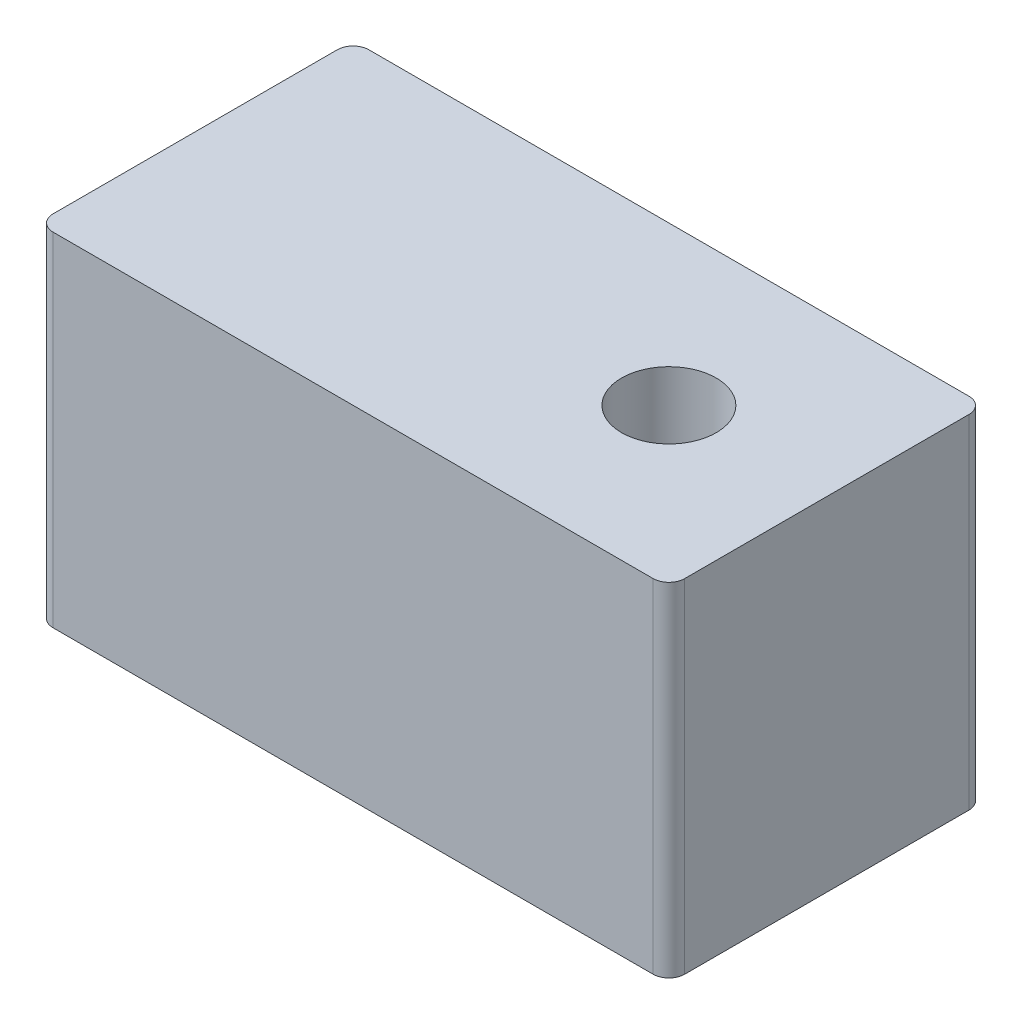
from build123d import *

# Parameters (mm, degrees)
Z_KLAD_PROTA_EN_DEPTH    = 21.7
SKICA2_R                 = 3
ODEBRAT_VYSUNUT_M1_DEPTH = 10


with BuildPart() as part:
    # Skica1 → Z_klad-Prota_en (new body)
    with BuildSketch(Plane(origin=(0, 0, 0), x_dir=(1, 0, 0), z_dir=(0, 1, 0))):
        with BuildLine():
            Line((-19, 10), (19, 10))
            ThreePointArc((19, 10), (19.707106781, 9.707106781), (20, 9))
            Line((20, 9), (20, -9))
            ThreePointArc((20, -9), (19.707106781, -9.707106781), (19, -10))
            Line((19, -10), (-19, -10))
            ThreePointArc((-19, -10), (-19.707106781, -9.707106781), (-20, -9))
            Line((-20, -9), (-20, 9))
            ThreePointArc((-20, 9), (-19.707106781, 9.707106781), (-19, 10))
        make_face()
    extrude(amount=Z_KLAD_PROTA_EN_DEPTH)

    # Skica2 → Odebrat vysunut_m1 (cut)
    with BuildSketch(Plane(origin=(0, 21.7, 0), x_dir=(-1, 0, 0), z_dir=(0, 1, 0))):
        with Locations(Location((-10, 0, 0), (0, 0, 90))):
            Circle(SKICA2_R)
    extrude(amount=-ODEBRAT_VYSUNUT_M1_DEPTH, mode=Mode.SUBTRACT)


solid = part.part
